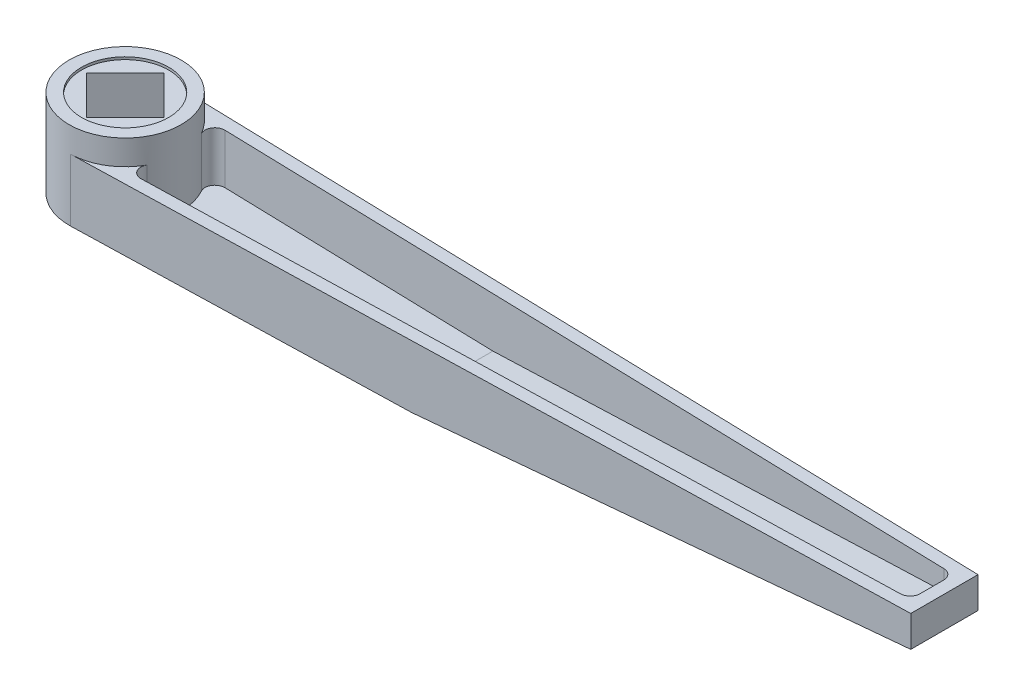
from build123d import *

# Parameters (mm, degrees)
EXTRUDE_X1_DEPTH          = 25
CUT_EXTRUDE_X2_DEPTH      = 331.714182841
CUT_EXTRUDE_X2_DEPTH_BACK = 331.714182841
SHELL_S1_T                = -5
SKETCH_C_R                = 22.5
EXTRUDE_X3_DEPTH          = 35
SKETCH_D_R                = 17.5
CUT_EXTRUDE_X5_DEPTH      = 1
CUT_EXTRUDE_START         = -1
SKETCH_E_R                = 17.5
CUT_EXTRUDE_X6_DEPTH      = 1
CUT_EXTRUDE_X7_DEPTH      = 332.516590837
FILLET_F1_R               = 4


with BuildPart() as part:
    # Sketch A → Extrude X1 (new body)
    with BuildSketch(Plane(origin=(0, 0, 0), x_dir=(1, 0, 0), z_dir=(0, 1, 0))):
        Polygon((0.615847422, 22.491570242), (329, 13.5), (329, -13.5), (0.615847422, -22.491570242), align=None)
    extrude(amount=EXTRUDE_X1_DEPTH)

    # Sketch B → Cut-Extrude X2 (cut, two sides: drawn at the far end of the back side and taken through both)
    with BuildSketch(Plane.XY.offset(-CUT_EXTRUDE_X2_DEPTH_BACK)):
        Polygon((329, 12.5), (134, 0), (134, -74.146668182), (362.466184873, -74.146668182), (356.911911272, 12.5), align=None)
    extrude(amount=CUT_EXTRUDE_X2_DEPTH + CUT_EXTRUDE_X2_DEPTH_BACK, mode=Mode.SUBTRACT)

    # Shell S1
    shell_s1_openings = [part.faces().sort_by_distance(p)[0] for p in [
        (151.13486474, 25, 0),
        (0.615847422, 12.5, 0),
    ]]
    offset(amount=SHELL_S1_T, openings=shell_s1_openings, kind=Kind.INTERSECTION)

    # Sketch C → Extrude X3 (add)
    with BuildSketch(Plane(origin=(0, 0, 0), x_dir=(1, 0, 0), z_dir=(0, 1, 0))):
        with Locations(Location((0, 0, 0), (0, 0, 88.431561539))):
            Circle(SKETCH_C_R)
    extrude(amount=EXTRUDE_X3_DEPTH)

    # Sketch D → Cut-Extrude X5 (cut)
    with BuildSketch(Plane(origin=(0, 35, 0), x_dir=(1, 0, 0), z_dir=(0, 1, 0))):
        with Locations(Location((0, 0, 0), (0, 0, 270))):
            Circle(SKETCH_D_R)
    extrude(amount=-CUT_EXTRUDE_X5_DEPTH, mode=Mode.SUBTRACT)

    # Sketch E → Cut-Extrude X6 (cut)
    with BuildSketch(Plane.XZ.offset(CUT_EXTRUDE_START)):
        with Locations(Location((0, 0, 0), (0, 0, 90))):
            Circle(SKETCH_E_R)
    extrude(amount=CUT_EXTRUDE_X6_DEPTH, mode=Mode.SUBTRACT)

    # Sketch F → Cut-Extrude X7 (cut, through all)
    with BuildSketch(Plane(origin=(0, 1, 0), x_dir=(1, 0, 0), z_dir=(0, 1, 0))):
        Polygon((0, 15.556349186), (-15.556349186, 0), (0, -15.556349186), (15.556349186, 0), align=None)
    extrude(amount=CUT_EXTRUDE_X7_DEPTH, mode=Mode.SUBTRACT)

    # Fillet F1
    fillet_f1_edges = [part.edges().sort_by_distance(p)[0] for p in [
        (324, 21.094874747, 8.635032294),
        (324, 21.094874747, -8.635032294),
        (14.615829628, 15, -17.106359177),
        (14.615829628, 15, 17.106359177),
    ]]
    fillet(fillet_f1_edges, radius=FILLET_F1_R)


solid = part.part
